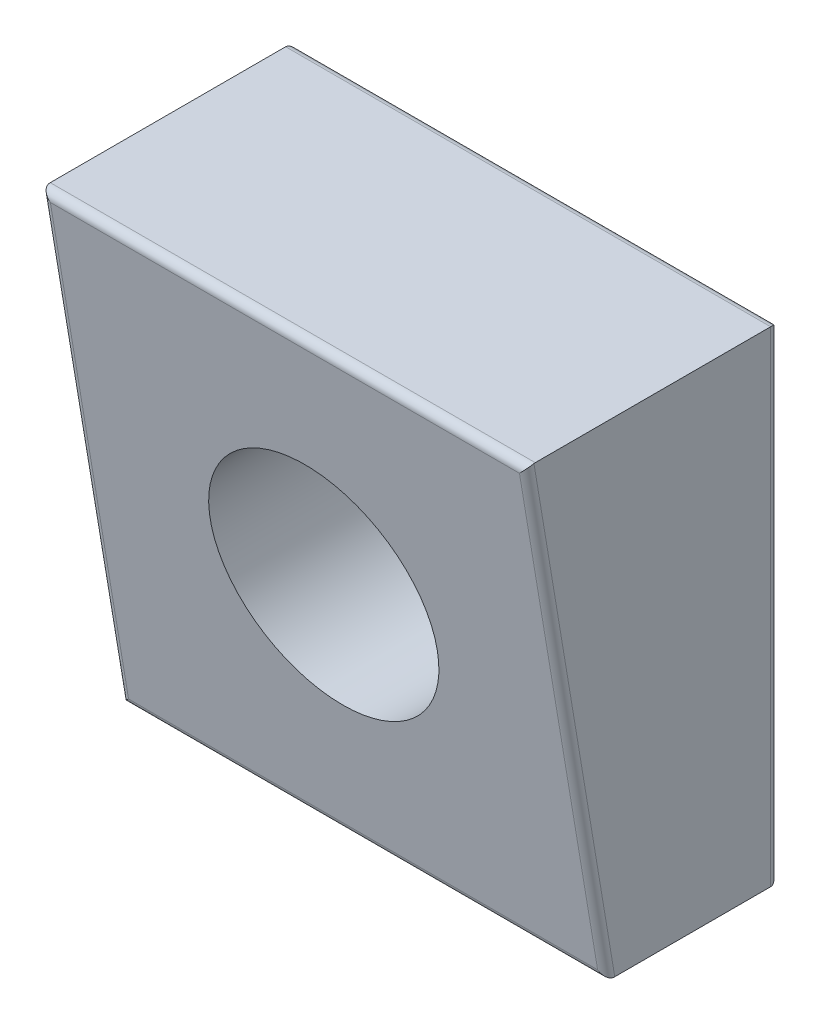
from build123d import *

# Parameters (mm, degrees)
BOSS_EXTRUDE1_DEPTH     = 15.24
CUT_EXTRUDE1_DEPTH      = 27.772693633
CUT_EXTRUDE1_DEPTH_BACK = 27.772693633
SKETCH1_R               = 7.1374
FILLET1_R               = 0.5
FILLET2_R               = 0.5


with BuildPart() as part:
    # Sketch3 → Boss-Extrude1 (new, symmetric)
    with BuildSketch(Plane.YZ):
        Polygon((-15.24, 0), (15.24, 0), (15.24, 15.882755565), (-15.24, 10.802384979), align=None)
    extrude(amount=BOSS_EXTRUDE1_DEPTH, both=True)

    # Sketch1 → Cut-Extrude1 (cut, two sides: drawn at the far end of the back side and taken through both)
    with BuildSketch(Plane(origin=(0, 0, 0), x_dir=(0, 1, 0), z_dir=(0, 0, 1)).offset(-CUT_EXTRUDE1_DEPTH_BACK)):
        with Locations(Location((0, 0, 0), (0, 0, 180))):
            Circle(SKETCH1_R)
    extrude(amount=CUT_EXTRUDE1_DEPTH + CUT_EXTRUDE1_DEPTH_BACK, mode=Mode.SUBTRACT)

    # Fillet1
    fillet1_edges = [part.edges().sort_by_distance(p)[0] for p in [
        (15.24, 0, 13.342570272),
        (-15.24, 0, 13.342570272),
        (0, -15.24, 10.802384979),
        (0, 15.24, 15.882755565),
    ]]
    fillet(fillet1_edges, radius=FILLET1_R)

    # Fillet2
    fillet2_edges = [part.edges().sort_by_distance(p)[0] for p in [
        (-15.24, 0, 0),
        (0, 15.24, 0),
        (0, -15.24, 0),
        (15.24, 0, 0),
    ]]
    fillet(fillet2_edges, radius=FILLET2_R)


solid = part.part
